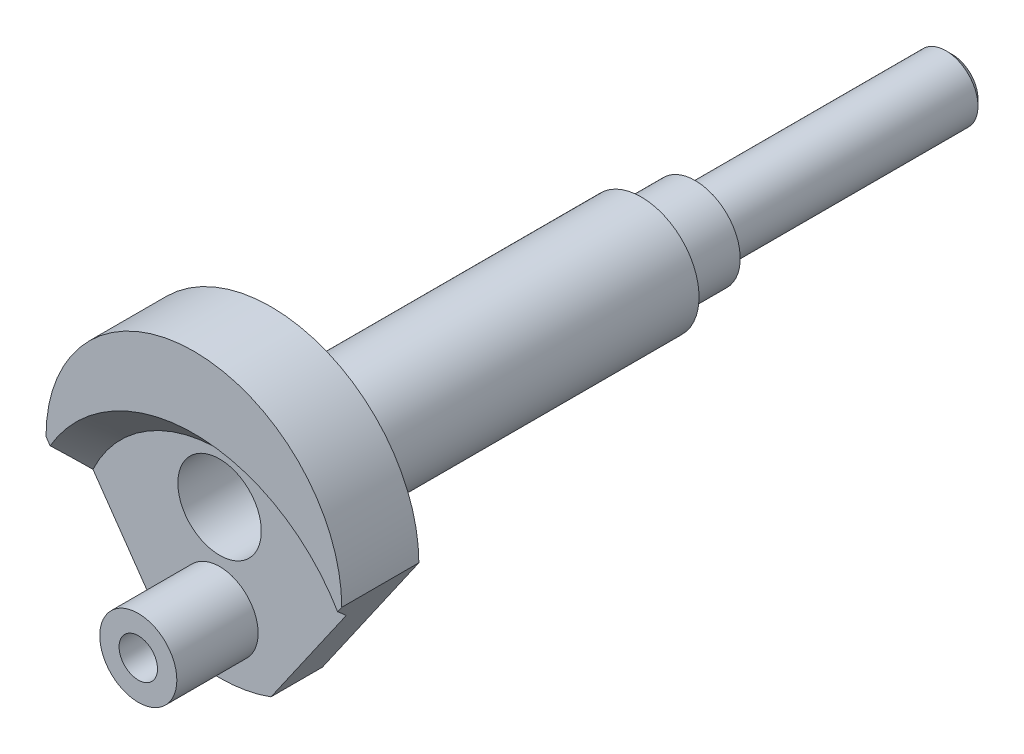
ISO-10303-21;
HEADER;
FILE_DESCRIPTION(('STEP AP214'),'2;1');
FILE_NAME('part.step','',(''),(''),'','','');
FILE_SCHEMA(('AUTOMOTIVE_DESIGN { 1 0 10303 214 1 1 1 1 }'));
ENDSEC;
DATA;
#1=APPLICATION_CONTEXT('core data for automotive mechanical design processes');
#2=APPLICATION_PROTOCOL_DEFINITION('international standard','automotive_design',2000,#1);
#3=PRODUCT_CONTEXT('',#1,'mechanical');
#4=PRODUCT('Part','Part','',(#3));
#5=PRODUCT_RELATED_PRODUCT_CATEGORY('part','',(#4));
#6=PRODUCT_DEFINITION_FORMATION('','',#4);
#7=PRODUCT_DEFINITION_CONTEXT('part definition',#1,'design');
#8=PRODUCT_DEFINITION('design','',#6,#7);
#9=PRODUCT_DEFINITION_SHAPE('','',#8);
#10=(LENGTH_UNIT() NAMED_UNIT(*) SI_UNIT(.MILLI.,.METRE.));
#11=(NAMED_UNIT(*) PLANE_ANGLE_UNIT() SI_UNIT($,.RADIAN.));
#12=(NAMED_UNIT(*) SI_UNIT($,.STERADIAN.) SOLID_ANGLE_UNIT());
#13=UNCERTAINTY_MEASURE_WITH_UNIT(LENGTH_MEASURE(1.E-05),#10,'distance_accuracy_value','');
#14=(GEOMETRIC_REPRESENTATION_CONTEXT(3) GLOBAL_UNCERTAINTY_ASSIGNED_CONTEXT((#13)) GLOBAL_UNIT_ASSIGNED_CONTEXT((#10,
#11,#12)) REPRESENTATION_CONTEXT('',''));
#15=CARTESIAN_POINT('',(0.,0.,0.));
#16=DIRECTION('',(0.,0.,1.));
#17=DIRECTION('',(1.,0.,0.));
#18=AXIS2_PLACEMENT_3D('',#15,#16,#17);
#19=CARTESIAN_POINT('',(0.,0.,-114.778366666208));
#20=DIRECTION('',(0.,0.,-1.));
#21=DIRECTION('',(-1.,0.,0.));
#22=AXIS2_PLACEMENT_3D('',#19,#20,#21);
#23=CYLINDRICAL_SURFACE('',#22,7.4083333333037);
#24=CARTESIAN_POINT('',(0.,0.,-60.9938666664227));
#25=DIRECTION('',(0.,0.,-1.));
#26=DIRECTION('',(-1.,0.,0.));
#27=AXIS2_PLACEMENT_3D('',#24,#25,#26);
#28=CIRCLE('',#27,7.4083333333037);
#29=CARTESIAN_POINT('',(-7.4083333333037,0.,-60.9938666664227));
#30=VERTEX_POINT('',#29);
#31=EDGE_CURVE('E105',#30,#30,#28,.T.);
#32=ORIENTED_EDGE('',*,*,#31,.T.);
#33=EDGE_LOOP('',(#32));
#34=FACE_BOUND('',#33,.T.);
#35=CARTESIAN_POINT('',(0.,0.,-69.8838666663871));
#36=DIRECTION('',(0.,0.,-1.));
#37=DIRECTION('',(-1.,0.,0.));
#38=AXIS2_PLACEMENT_3D('',#35,#36,#37);
#39=CIRCLE('',#38,7.4083333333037);
#40=CARTESIAN_POINT('',(-7.4083333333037,0.,-69.8838666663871));
#41=VERTEX_POINT('',#40);
#42=EDGE_CURVE('E210',#41,#41,#39,.T.);
#43=ORIENTED_EDGE('',*,*,#42,.F.);
#44=EDGE_LOOP('',(#43));
#45=FACE_BOUND('',#44,.T.);
#46=ADVANCED_FACE('F32',(#34,#45),#23,.T.);
#47=CARTESIAN_POINT('',(0.,0.,-117.828059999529));
#48=DIRECTION('',(0.,0.,-1.));
#49=DIRECTION('',(-1.,0.,0.));
#50=AXIS2_PLACEMENT_3D('',#47,#48,#49);
#51=CYLINDRICAL_SURFACE('',#50,9.51653333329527);
#52=CARTESIAN_POINT('',(0.,0.,0.));
#53=DIRECTION('',(0.,0.,-1.));
#54=DIRECTION('',(-1.,0.,0.));
#55=AXIS2_PLACEMENT_3D('',#52,#53,#54);
#56=CIRCLE('',#55,9.51653333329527);
#57=CARTESIAN_POINT('',(-9.51653333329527,0.,0.));
#58=VERTEX_POINT('',#57);
#59=EDGE_CURVE('E242',#58,#58,#56,.T.);
#60=ORIENTED_EDGE('',*,*,#59,.T.);
#61=EDGE_LOOP('',(#60));
#62=FACE_BOUND('',#61,.T.);
#63=CARTESIAN_POINT('',(0.,0.,-60.9938666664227));
#64=DIRECTION('',(0.,0.,-1.));
#65=DIRECTION('',(-1.,0.,0.));
#66=AXIS2_PLACEMENT_3D('',#63,#64,#65);
#67=CIRCLE('',#66,9.51653333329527);
#68=CARTESIAN_POINT('',(-9.51653333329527,0.,-60.9938666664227));
#69=VERTEX_POINT('',#68);
#70=EDGE_CURVE('E215',#69,#69,#67,.T.);
#71=ORIENTED_EDGE('',*,*,#70,.F.);
#72=EDGE_LOOP('',(#71));
#73=FACE_BOUND('',#72,.T.);
#74=ADVANCED_FACE('F158',(#62,#73),#51,.T.);
#75=CARTESIAN_POINT('',(0.,0.,12.6999999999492));
#76=DIRECTION('',(0.,0.,-1.));
#77=DIRECTION('',(-1.,0.,0.));
#78=AXIS2_PLACEMENT_3D('',#75,#76,#77);
#79=CYLINDRICAL_SURFACE('',#78,24.3585999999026);
#80=CARTESIAN_POINT('',(0.,0.,8.4666666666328));
#81=DIRECTION('',(0.,0.,-1.));
#82=DIRECTION('',(-1.,0.,0.));
#83=AXIS2_PLACEMENT_3D('',#80,#81,#82);
#84=CIRCLE('',#83,24.3585999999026);
#85=CARTESIAN_POINT('',(8.4666666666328,-22.8398106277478,8.4666666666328));
#86=VERTEX_POINT('',#85);
#87=CARTESIAN_POINT('',(-8.4666666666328,-22.8398106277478,8.4666666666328));
#88=VERTEX_POINT('',#87);
#89=EDGE_CURVE('E104',#86,#88,#84,.T.);
#90=ORIENTED_EDGE('',*,*,#89,.T.);
#91=DIRECTION('',(0.,0.,1.));
#92=VECTOR('',#91,1.);
#93=CARTESIAN_POINT('',(-8.4666666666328,-22.8398106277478,0.));
#94=LINE('',#93,#92);
#95=CARTESIAN_POINT('',(-8.4666666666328,-22.8398106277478,0.));
#96=VERTEX_POINT('',#95);
#97=EDGE_CURVE('E90',#96,#88,#94,.T.);
#98=ORIENTED_EDGE('',*,*,#97,.F.);
#99=CARTESIAN_POINT('',(0.,0.,0.));
#100=DIRECTION('',(0.,0.,1.));
#101=DIRECTION('',(1.,0.,0.));
#102=AXIS2_PLACEMENT_3D('',#99,#100,#101);
#103=CIRCLE('',#102,24.3585999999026);
#104=CARTESIAN_POINT('',(8.4666666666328,-22.8398106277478,0.));
#105=VERTEX_POINT('',#104);
#106=EDGE_CURVE('E101',#96,#105,#103,.T.);
#107=ORIENTED_EDGE('',*,*,#106,.T.);
#108=DIRECTION('',(0.,0.,1.));
#109=VECTOR('',#108,1.);
#110=CARTESIAN_POINT('',(8.4666666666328,-22.8398106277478,0.));
#111=LINE('',#110,#109);
#112=EDGE_CURVE('E226',#105,#86,#111,.T.);
#113=ORIENTED_EDGE('',*,*,#112,.T.);
#114=EDGE_LOOP('',(#90,#98,#107,#113));
#115=FACE_BOUND('',#114,.T.);
#116=ADVANCED_FACE('F100',(#115),#79,.T.);
#117=CARTESIAN_POINT('',(24.3585999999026,0.,0.));
#118=VERTEX_POINT('',#117);
#119=CARTESIAN_POINT('',(-24.3585999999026,0.,0.));
#120=VERTEX_POINT('',#119);
#121=EDGE_CURVE('E111',#118,#120,#103,.T.);
#122=ORIENTED_EDGE('',*,*,#121,.T.);
#123=DIRECTION('',(0.,0.,1.));
#124=VECTOR('',#123,1.);
#125=CARTESIAN_POINT('',(-24.3585999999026,0.,0.));
#126=LINE('',#125,#124);
#127=CARTESIAN_POINT('',(-24.3585999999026,0.,12.6999999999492));
#128=VERTEX_POINT('',#127);
#129=EDGE_CURVE('E92',#120,#128,#126,.T.);
#130=ORIENTED_EDGE('',*,*,#129,.T.);
#131=CARTESIAN_POINT('',(0.,0.,12.6999999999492));
#132=DIRECTION('',(0.,0.,1.));
#133=DIRECTION('',(1.,0.,0.));
#134=AXIS2_PLACEMENT_3D('',#131,#132,#133);
#135=CIRCLE('',#134,24.3585999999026);
#136=CARTESIAN_POINT('',(24.3585999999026,0.,12.6999999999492));
#137=VERTEX_POINT('',#136);
#138=EDGE_CURVE('E114',#137,#128,#135,.T.);
#139=ORIENTED_EDGE('',*,*,#138,.F.);
#140=DIRECTION('',(0.,0.,1.));
#141=VECTOR('',#140,1.);
#142=CARTESIAN_POINT('',(24.3585999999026,0.,0.));
#143=LINE('',#142,#141);
#144=EDGE_CURVE('E228',#118,#137,#143,.T.);
#145=ORIENTED_EDGE('',*,*,#144,.F.);
#146=EDGE_LOOP('',(#122,#130,#139,#145));
#147=FACE_BOUND('',#146,.T.);
#148=ADVANCED_FACE('F263',(#147),#79,.T.);
#149=CARTESIAN_POINT('',(0.,0.,12.6999999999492));
#150=DIRECTION('',(0.,0.,1.));
#151=DIRECTION('',(1.,0.,0.));
#152=AXIS2_PLACEMENT_3D('',#149,#150,#151);
#153=PLANE('',#152);
#154=DIRECTION('',(-0.571146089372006,0.820848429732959,0.));
#155=VECTOR('',#154,1.);
#156=CARTESIAN_POINT('',(-16.4126333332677,-11.4199053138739,12.6999999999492));
#157=LINE('',#156,#155);
#158=CARTESIAN_POINT('',(-23.6821601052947,-0.972176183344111,12.6999999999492));
#159=VERTEX_POINT('',#158);
#160=EDGE_CURVE('E224',#159,#128,#157,.T.);
#161=ORIENTED_EDGE('',*,*,#160,.F.);
#162=CARTESIAN_POINT('',(0.,-14.8166666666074,12.6999999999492));
#163=DIRECTION('',(0.,0.,-1.));
#164=DIRECTION('',(-1.,0.,0.));
#165=AXIS2_PLACEMENT_3D('',#162,#163,#164);
#166=CIRCLE('',#165,27.4319999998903);
#167=CARTESIAN_POINT('',(23.6821601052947,-0.972176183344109,12.6999999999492));
#168=VERTEX_POINT('',#167);
#169=EDGE_CURVE('E112',#159,#168,#166,.T.);
#170=ORIENTED_EDGE('',*,*,#169,.T.);
#171=DIRECTION('',(0.571146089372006,0.820848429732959,0.));
#172=VECTOR('',#171,1.);
#173=CARTESIAN_POINT('',(16.4126333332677,-11.4199053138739,12.6999999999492));
#174=LINE('',#173,#172);
#175=EDGE_CURVE('E55',#168,#137,#174,.T.);
#176=ORIENTED_EDGE('',*,*,#175,.T.);
#177=ORIENTED_EDGE('',*,*,#138,.T.);
#178=EDGE_LOOP('',(#161,#170,#176,#177));
#179=FACE_BOUND('',#178,.T.);
#180=ADVANCED_FACE('F181',(#179),#153,.T.);
#181=CARTESIAN_POINT('',(0.,0.,0.));
#182=DIRECTION('',(0.,0.,1.));
#183=DIRECTION('',(1.,0.,0.));
#184=AXIS2_PLACEMENT_3D('',#181,#182,#183);
#185=PLANE('',#184);
#186=ORIENTED_EDGE('',*,*,#59,.F.);
#187=EDGE_LOOP('',(#186));
#188=FACE_BOUND('',#187,.T.);
#189=ORIENTED_EDGE('',*,*,#106,.F.);
#190=DIRECTION('',(-0.571146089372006,0.820848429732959,0.));
#191=VECTOR('',#190,1.);
#192=CARTESIAN_POINT('',(-8.4666666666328,-22.8398106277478,0.));
#193=LINE('',#192,#191);
#194=EDGE_CURVE('E87',#96,#120,#193,.T.);
#195=ORIENTED_EDGE('',*,*,#194,.T.);
#196=ORIENTED_EDGE('',*,*,#121,.F.);
#197=DIRECTION('',(0.571146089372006,0.820848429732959,0.));
#198=VECTOR('',#197,1.);
#199=CARTESIAN_POINT('',(8.4666666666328,-22.8398106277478,0.));
#200=LINE('',#199,#198);
#201=EDGE_CURVE('E109',#105,#118,#200,.T.);
#202=ORIENTED_EDGE('',*,*,#201,.F.);
#203=EDGE_LOOP('',(#189,#195,#196,#202));
#204=FACE_BOUND('',#203,.T.);
#205=ADVANCED_FACE('F107',(#188,#204),#185,.F.);
#206=CARTESIAN_POINT('',(0.,-14.8166666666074,8.4666666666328));
#207=DIRECTION('',(0.,0.,-1.));
#208=DIRECTION('',(-1.,0.,0.));
#209=AXIS2_PLACEMENT_3D('',#206,#207,#208);
#210=PLANE('',#209);
#211=CARTESIAN_POINT('',(0.,-14.8166666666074,8.4666666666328));
#212=DIRECTION('',(0.,0.,1.));
#213=DIRECTION('',(1.,0.,0.));
#214=AXIS2_PLACEMENT_3D('',#211,#212,#213);
#215=CIRCLE('',#214,6.3499999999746);
#216=CARTESIAN_POINT('',(6.3499999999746,-14.8166666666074,8.4666666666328));
#217=VERTEX_POINT('',#216);
#218=EDGE_CURVE('E251',#217,#217,#215,.T.);
#219=ORIENTED_EDGE('',*,*,#218,.F.);
#220=EDGE_LOOP('',(#219));
#221=FACE_BOUND('',#220,.T.);
#222=CARTESIAN_POINT('',(0.,0.,8.4666666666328));
#223=DIRECTION('',(0.,0.,-1.));
#224=DIRECTION('',(-1.,0.,0.));
#225=AXIS2_PLACEMENT_3D('',#222,#223,#224);
#226=CIRCLE('',#225,6.87493333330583);
#227=CARTESIAN_POINT('',(-6.87493333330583,0.,8.4666666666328));
#228=VERTEX_POINT('',#227);
#229=EDGE_CURVE('E239',#228,#228,#226,.T.);
#230=ORIENTED_EDGE('',*,*,#229,.T.);
#231=EDGE_LOOP('',(#230));
#232=FACE_BOUND('',#231,.T.);
#233=CARTESIAN_POINT('',(0.,-14.8166666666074,8.4666666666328));
#234=DIRECTION('',(0.,0.,-1.));
#235=DIRECTION('',(-1.,0.,0.));
#236=AXIS2_PLACEMENT_3D('',#233,#234,#235);
#237=CIRCLE('',#236,23.0293333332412);
#238=CARTESIAN_POINT('',(-20.8513496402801,-5.0406034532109,8.4666666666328));
#239=VERTEX_POINT('',#238);
#240=CARTESIAN_POINT('',(20.8513496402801,-5.04060345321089,8.4666666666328));
#241=VERTEX_POINT('',#240);
#242=EDGE_CURVE('E115',#239,#241,#237,.T.);
#243=ORIENTED_EDGE('',*,*,#242,.F.);
#244=DIRECTION('',(0.571146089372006,-0.820848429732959,0.));
#245=VECTOR('',#244,1.);
#246=CARTESIAN_POINT('',(-9.46621890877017,-21.4032589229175,8.4666666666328));
#247=LINE('',#246,#245);
#248=EDGE_CURVE('E47',#239,#88,#247,.T.);
#249=ORIENTED_EDGE('',*,*,#248,.T.);
#250=ORIENTED_EDGE('',*,*,#89,.F.);
#251=DIRECTION('',(-0.571146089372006,-0.820848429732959,0.));
#252=VECTOR('',#251,1.);
#253=CARTESIAN_POINT('',(9.46621890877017,-21.4032589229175,8.4666666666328));
#254=LINE('',#253,#252);
#255=EDGE_CURVE('E231',#241,#86,#254,.T.);
#256=ORIENTED_EDGE('',*,*,#255,.F.);
#257=EDGE_LOOP('',(#243,#249,#250,#256));
#258=FACE_BOUND('',#257,.T.);
#259=ADVANCED_FACE('F173',(#221,#232,#258),#210,.F.);
#260=CARTESIAN_POINT('',(0.,-14.8166666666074,8.4666666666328));
#261=DIRECTION('',(0.,0.,1.));
#262=DIRECTION('',(1.,0.,0.));
#263=AXIS2_PLACEMENT_3D('',#260,#261,#262);
#264=CONICAL_SURFACE('',#263,23.0293333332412,0.805003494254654);
#265=ORIENTED_EDGE('',*,*,#169,.F.);
#266=CARTESIAN_POINT('',(-23.6822910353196,-0.971988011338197,12.7001999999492));
#267=CARTESIAN_POINT('',(-23.4484850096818,-1.30801291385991,12.3430675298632));
#268=CARTESIAN_POINT('',(-23.2142457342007,-1.6446604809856,11.9868018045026));
#269=CARTESIAN_POINT('',(-22.744768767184,-2.31939053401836,11.2763209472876));
#270=CARTESIAN_POINT('',(-22.5095311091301,-2.65747297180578,10.9221057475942));
#271=CARTESIAN_POINT('',(-22.0379079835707,-3.33528747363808,10.2160163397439));
#272=CARTESIAN_POINT('',(-21.8015225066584,-3.67501955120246,9.86414215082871));
#273=CARTESIAN_POINT('',(-21.3274143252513,-4.35640556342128,9.1631390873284));
#274=CARTESIAN_POINT('',(-21.0896915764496,-4.69805956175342,8.81401030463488));
#275=CARTESIAN_POINT('',(-20.8512123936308,-5.04080070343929,8.4664666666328));
#276=B_SPLINE_CURVE_WITH_KNOTS('',3,(#266,#267,#268,#269,#270,#271,#272,#273,#274,#275),
.UNSPECIFIED.,.F.,.F.,(4,2,2,2,4),(0.,1.62975420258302,3.25945417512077,4.88916752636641,
6.51893519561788),.UNSPECIFIED.);
#277=EDGE_CURVE('E128',#159,#239,#276,.T.);
#278=ORIENTED_EDGE('',*,*,#277,.T.);
#279=ORIENTED_EDGE('',*,*,#242,.T.);
#280=CARTESIAN_POINT('',(23.6822910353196,-0.971988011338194,12.7001999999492));
#281=CARTESIAN_POINT('',(23.4484850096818,-1.30801291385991,12.3430675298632));
#282=CARTESIAN_POINT('',(23.2142457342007,-1.6446604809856,11.9868018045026));
#283=CARTESIAN_POINT('',(22.744768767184,-2.31939053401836,11.2763209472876));
#284=CARTESIAN_POINT('',(22.5095311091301,-2.65747297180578,10.9221057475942));
#285=CARTESIAN_POINT('',(22.0379079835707,-3.33528747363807,10.2160163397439));
#286=CARTESIAN_POINT('',(21.8015225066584,-3.67501955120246,9.86414215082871));
#287=CARTESIAN_POINT('',(21.3274143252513,-4.35640556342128,9.1631390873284));
#288=CARTESIAN_POINT('',(21.0896915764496,-4.69805956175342,8.81401030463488));
#289=CARTESIAN_POINT('',(20.8512123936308,-5.04080070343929,8.4664666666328));
#290=B_SPLINE_CURVE_WITH_KNOTS('',3,(#280,#281,#282,#283,#284,#285,#286,#287,#288,#289),
.UNSPECIFIED.,.F.,.F.,(4,2,2,2,4),(0.,1.62975420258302,3.25945417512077,4.88916752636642,
6.51893519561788),.UNSPECIFIED.);
#291=EDGE_CURVE('E120',#168,#241,#290,.T.);
#292=ORIENTED_EDGE('',*,*,#291,.F.);
#293=EDGE_LOOP('',(#265,#278,#279,#292));
#294=FACE_BOUND('',#293,.T.);
#295=ADVANCED_FACE('F133',(#294),#264,.F.);
#296=CARTESIAN_POINT('',(0.,-14.8166666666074,22.5249570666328));
#297=DIRECTION('',(0.,0.,1.));
#298=DIRECTION('',(1.,0.,0.));
#299=AXIS2_PLACEMENT_3D('',#296,#297,#298);
#300=CYLINDRICAL_SURFACE('',#299,3.16653333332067);
#301=CARTESIAN_POINT('',(0.,-14.8166666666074,21.8555146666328));
#302=DIRECTION('',(0.,0.,1.));
#303=DIRECTION('',(1.,0.,0.));
#304=AXIS2_PLACEMENT_3D('',#301,#302,#303);
#305=CIRCLE('',#304,3.16653333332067);
#306=CARTESIAN_POINT('',(3.16653333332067,-14.8166666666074,21.8555146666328));
#307=VERTEX_POINT('',#306);
#308=EDGE_CURVE('E245',#307,#307,#305,.T.);
#309=ORIENTED_EDGE('',*,*,#308,.T.);
#310=EDGE_LOOP('',(#309));
#311=FACE_BOUND('',#310,.T.);
#312=CARTESIAN_POINT('',(0.,-14.8166666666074,8.4666666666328));
#313=DIRECTION('',(0.,0.,1.));
#314=DIRECTION('',(1.,0.,0.));
#315=AXIS2_PLACEMENT_3D('',#312,#313,#314);
#316=CIRCLE('',#315,3.16653333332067);
#317=CARTESIAN_POINT('',(3.16653333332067,-14.8166666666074,8.4666666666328));
#318=VERTEX_POINT('',#317);
#319=EDGE_CURVE('E254',#318,#318,#316,.T.);
#320=ORIENTED_EDGE('',*,*,#319,.F.);
#321=EDGE_LOOP('',(#320));
#322=FACE_BOUND('',#321,.T.);
#323=ADVANCED_FACE('F169',(#311,#322),#300,.F.);
#324=CARTESIAN_POINT('',(0.,-14.8166666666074,22.5249570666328));
#325=DIRECTION('',(0.,0.,1.));
#326=DIRECTION('',(1.,0.,0.));
#327=AXIS2_PLACEMENT_3D('',#324,#325,#326);
#328=CYLINDRICAL_SURFACE('',#327,6.3499999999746);
#329=ORIENTED_EDGE('',*,*,#218,.T.);
#330=EDGE_LOOP('',(#329));
#331=FACE_BOUND('',#330,.T.);
#332=CARTESIAN_POINT('',(0.,-14.8166666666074,21.8555146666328));
#333=DIRECTION('',(0.,0.,1.));
#334=DIRECTION('',(1.,0.,0.));
#335=AXIS2_PLACEMENT_3D('',#332,#333,#334);
#336=CIRCLE('',#335,6.3499999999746);
#337=CARTESIAN_POINT('',(6.3499999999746,-14.8166666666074,21.8555146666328));
#338=VERTEX_POINT('',#337);
#339=EDGE_CURVE('E248',#338,#338,#336,.T.);
#340=ORIENTED_EDGE('',*,*,#339,.F.);
#341=EDGE_LOOP('',(#340));
#342=FACE_BOUND('',#341,.T.);
#343=ADVANCED_FACE('F165',(#331,#342),#328,.T.);
#344=CARTESIAN_POINT('',(6.3499999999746,-14.8166666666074,21.8555146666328));
#345=DIRECTION('',(0.,0.,1.));
#346=DIRECTION('',(1.,0.,0.));
#347=AXIS2_PLACEMENT_3D('',#344,#345,#346);
#348=PLANE('',#347);
#349=ORIENTED_EDGE('',*,*,#339,.T.);
#350=EDGE_LOOP('',(#349));
#351=FACE_BOUND('',#350,.T.);
#352=ORIENTED_EDGE('',*,*,#308,.F.);
#353=EDGE_LOOP('',(#352));
#354=FACE_BOUND('',#353,.T.);
#355=ADVANCED_FACE('F162',(#351,#354),#348,.T.);
#356=ORIENTED_EDGE('',*,*,#319,.T.);
#357=EDGE_LOOP('',(#356));
#358=FACE_BOUND('',#357,.T.);
#359=ADVANCED_FACE('F151',(#358),#210,.F.);
#360=CARTESIAN_POINT('',(0.,0.,-35.7060401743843));
#361=DIRECTION('',(0.,0.,-1.));
#362=DIRECTION('',(-1.,0.,0.));
#363=AXIS2_PLACEMENT_3D('',#360,#361,#362);
#364=CYLINDRICAL_SURFACE('',#363,6.87493333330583);
#365=ORIENTED_EDGE('',*,*,#229,.F.);
#366=EDGE_LOOP('',(#365));
#367=FACE_BOUND('',#366,.T.);
#368=CARTESIAN_POINT('',(0.,0.,-29.6333333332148));
#369=DIRECTION('',(0.,0.,-1.));
#370=DIRECTION('',(-1.,0.,0.));
#371=AXIS2_PLACEMENT_3D('',#368,#369,#370);
#372=CIRCLE('',#371,6.87493333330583);
#373=CARTESIAN_POINT('',(-6.87493333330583,0.,-29.6333333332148));
#374=VERTEX_POINT('',#373);
#375=EDGE_CURVE('E236',#374,#374,#372,.T.);
#376=ORIENTED_EDGE('',*,*,#375,.T.);
#377=EDGE_LOOP('',(#376));
#378=FACE_BOUND('',#377,.T.);
#379=ADVANCED_FACE('F147',(#367,#378),#364,.F.);
#380=CARTESIAN_POINT('',(0.,0.,-33.6025779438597));
#381=DIRECTION('',(0.,0.,1.));
#382=DIRECTION('',(1.,0.,0.));
#383=AXIS2_PLACEMENT_3D('',#380,#381,#382);
#384=CONICAL_SURFACE('',#383,0.,1.0471975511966);
#385=ORIENTED_EDGE('',*,*,#375,.F.);
#386=EDGE_LOOP('',(#385));
#387=FACE_BOUND('',#386,.T.);
#388=CARTESIAN_POINT('',(0.,0.,-33.6025779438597));
#389=VERTEX_POINT('',#388);
#390=VERTEX_LOOP('',#389);
#391=FACE_BOUND('',#390,.T.);
#392=ADVANCED_FACE('F141',(#387,#391),#384,.F.);
#393=CARTESIAN_POINT('',(8.4666666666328,-22.8398106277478,0.));
#394=DIRECTION('',(0.820848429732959,-0.571146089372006,0.));
#395=DIRECTION('',(0.571146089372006,0.820848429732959,0.));
#396=AXIS2_PLACEMENT_3D('',#393,#394,#395);
#397=PLANE('',#396);
#398=ORIENTED_EDGE('',*,*,#175,.F.);
#399=ORIENTED_EDGE('',*,*,#291,.T.);
#400=ORIENTED_EDGE('',*,*,#255,.T.);
#401=ORIENTED_EDGE('',*,*,#112,.F.);
#402=ORIENTED_EDGE('',*,*,#201,.T.);
#403=ORIENTED_EDGE('',*,*,#144,.T.);
#404=EDGE_LOOP('',(#398,#399,#400,#401,#402,#403));
#405=FACE_BOUND('',#404,.T.);
#406=ADVANCED_FACE('F137',(#405),#397,.T.);
#407=CARTESIAN_POINT('',(-8.4666666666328,-22.8398106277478,0.));
#408=DIRECTION('',(0.820848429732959,0.571146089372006,0.));
#409=DIRECTION('',(-0.571146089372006,0.820848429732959,0.));
#410=AXIS2_PLACEMENT_3D('',#407,#408,#409);
#411=PLANE('',#410);
#412=ORIENTED_EDGE('',*,*,#277,.F.);
#413=ORIENTED_EDGE('',*,*,#160,.T.);
#414=ORIENTED_EDGE('',*,*,#129,.F.);
#415=ORIENTED_EDGE('',*,*,#194,.F.);
#416=ORIENTED_EDGE('',*,*,#97,.T.);
#417=ORIENTED_EDGE('',*,*,#248,.F.);
#418=EDGE_LOOP('',(#412,#413,#414,#415,#416,#417));
#419=FACE_BOUND('',#418,.T.);
#420=ADVANCED_FACE('F89',(#419),#411,.F.);
#421=CARTESIAN_POINT('',(0.,-7.4083333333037,-60.9938666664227));
#422=DIRECTION('',(0.,0.,-1.));
#423=DIRECTION('',(-1.,0.,0.));
#424=AXIS2_PLACEMENT_3D('',#421,#422,#423);
#425=PLANE('',#424);
#426=ORIENTED_EDGE('',*,*,#70,.T.);
#427=EDGE_LOOP('',(#426));
#428=FACE_BOUND('',#427,.T.);
#429=ORIENTED_EDGE('',*,*,#31,.F.);
#430=EDGE_LOOP('',(#429));
#431=FACE_BOUND('',#430,.T.);
#432=ADVANCED_FACE('F195',(#428,#431),#425,.T.);
#433=CARTESIAN_POINT('',(0.,0.,-114.333866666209));
#434=DIRECTION('',(0.,0.,-1.));
#435=DIRECTION('',(-1.,0.,0.));
#436=AXIS2_PLACEMENT_3D('',#433,#434,#435);
#437=CYLINDRICAL_SURFACE('',#436,5.28319999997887);
#438=CARTESIAN_POINT('',(0.,0.,-111.175799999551));
#439=DIRECTION('',(0.,0.,-1.));
#440=DIRECTION('',(-1.,0.,0.));
#441=AXIS2_PLACEMENT_3D('',#438,#439,#440);
#442=CIRCLE('',#441,5.28319999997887);
#443=CARTESIAN_POINT('',(-5.28319999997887,0.,-111.175799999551));
#444=VERTEX_POINT('',#443);
#445=EDGE_CURVE('E11',#444,#444,#442,.F.);
#446=ORIENTED_EDGE('',*,*,#445,.T.);
#447=EDGE_LOOP('',(#446));
#448=FACE_BOUND('',#447,.T.);
#449=CARTESIAN_POINT('',(0.,0.,-69.8838666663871));
#450=DIRECTION('',(0.,0.,-1.));
#451=DIRECTION('',(-1.,0.,0.));
#452=AXIS2_PLACEMENT_3D('',#449,#450,#451);
#453=CIRCLE('',#452,5.28319999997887);
#454=CARTESIAN_POINT('',(-5.28319999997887,0.,-69.8838666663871));
#455=VERTEX_POINT('',#454);
#456=EDGE_CURVE('E213',#455,#455,#453,.T.);
#457=ORIENTED_EDGE('',*,*,#456,.T.);
#458=EDGE_LOOP('',(#457));
#459=FACE_BOUND('',#458,.T.);
#460=ADVANCED_FACE('F198',(#448,#459),#437,.T.);
#461=CARTESIAN_POINT('',(0.,-5.28319999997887,-69.8838666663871));
#462=DIRECTION('',(0.,0.,-1.));
#463=DIRECTION('',(-1.,0.,0.));
#464=AXIS2_PLACEMENT_3D('',#461,#462,#463);
#465=PLANE('',#464);
#466=ORIENTED_EDGE('',*,*,#42,.T.);
#467=EDGE_LOOP('',(#466));
#468=FACE_BOUND('',#467,.T.);
#469=ORIENTED_EDGE('',*,*,#456,.F.);
#470=EDGE_LOOP('',(#469));
#471=FACE_BOUND('',#470,.T.);
#472=ADVANCED_FACE('F156',(#468,#471),#465,.T.);
#473=CARTESIAN_POINT('',(-9.51653333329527,0.,-112.217199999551));
#474=DIRECTION('',(0.,0.,-1.));
#475=DIRECTION('',(-1.,0.,0.));
#476=AXIS2_PLACEMENT_3D('',#473,#474,#475);
#477=PLANE('',#476);
#478=CARTESIAN_POINT('',(0.,0.,-112.217199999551));
#479=DIRECTION('',(0.,0.,-1.));
#480=DIRECTION('',(-1.,0.,0.));
#481=AXIS2_PLACEMENT_3D('',#478,#479,#480);
#482=CIRCLE('',#481,4.24179999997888);
#483=CARTESIAN_POINT('',(-4.24179999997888,0.,-112.217199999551));
#484=VERTEX_POINT('',#483);
#485=EDGE_CURVE('E40',#484,#484,#482,.T.);
#486=ORIENTED_EDGE('',*,*,#485,.T.);
#487=EDGE_LOOP('',(#486));
#488=FACE_BOUND('',#487,.T.);
#489=ADVANCED_FACE('F153',(#488),#477,.T.);
#490=CARTESIAN_POINT('',(0.,0.,-112.217199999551));
#491=DIRECTION('',(0.,0.,1.));
#492=DIRECTION('',(1.,0.,0.));
#493=AXIS2_PLACEMENT_3D('',#490,#491,#492);
#494=CONICAL_SURFACE('',#493,4.24179999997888,0.785398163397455);
#495=ORIENTED_EDGE('',*,*,#445,.F.);
#496=EDGE_LOOP('',(#495));
#497=FACE_BOUND('',#496,.T.);
#498=ORIENTED_EDGE('',*,*,#485,.F.);
#499=EDGE_LOOP('',(#498));
#500=FACE_BOUND('',#499,.T.);
#501=ADVANCED_FACE('F34',(#497,#500),#494,.T.);
#502=CLOSED_SHELL('',(#46,#74,#116,#148,#180,#205,#259,#295,#323,#343,#355,#359,#379,#392,#406,
#420,#432,#460,#472,#489,#501));
#503=MANIFOLD_SOLID_BREP('B2',#502);
#504=ADVANCED_BREP_SHAPE_REPRESENTATION('',(#18,#503),#14);
#505=SHAPE_DEFINITION_REPRESENTATION(#9,#504);
ENDSEC;
END-ISO-10303-21;
